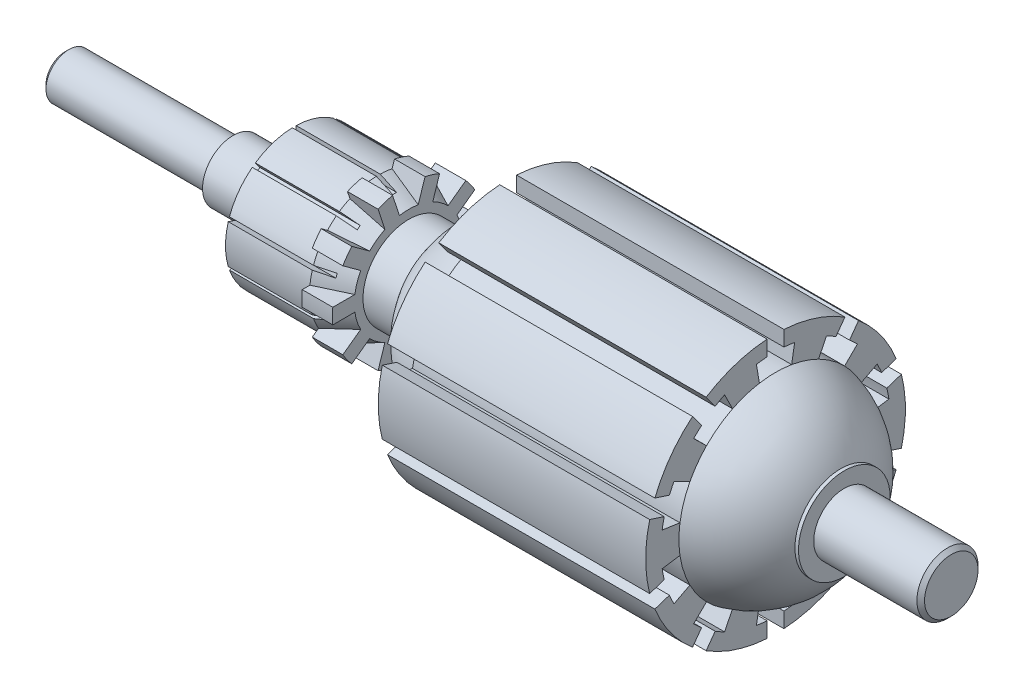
from build123d import *

# Parameters (mm, degrees)
CHANFREIN1_SIZE              = 0.5
ENL_V_MAT_EXTRU_1_DEPTH      = 63.785348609
R_P_TITION_CIRCULAIRE1_COUNT = 10
ENL_V_START                  = -4
ENL_V_MAT_EXTRU_2_DEPTH      = 4
R_P_TITION_CIRCULAIRE2_COUNT = 10
ESQUISSE4_R                  = 9
BOSS_EXTRU_1_DEPTH           = 4
BOSS_EXTRU_1_TAPER           = 25
ENL_V_MAT_EXTRU_3_REACH      = 91.29
R_P_TITION_CIRCULAIRE3_COUNT = 10


with BuildPart() as part:
    # Esquisse1 → Base-R_volution (revolve)
    with BuildSketch(Plane.XY, mode=Mode.PRIVATE) as base_r_volution_sk:
        with BuildLine():
            Line((0, 2.99), (22, 2.99))
            Line((22, 2.99), (22, 4))
            Line((22, 4), (30, 4))
            Line((30, 4), (30, 9))
            Line((30, 9), (41, 9))
            Line((41, 9), (41, 10))
            Line((41, 10), (45, 10))
            Line((45, 10), (45, 6))
            Line((45, 6), (49.467437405, 6))
            ThreePointArc((49.467437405, 6), (53.009285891, 10.25419368), (58, 12.649110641))
            Line((58, 12.649110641), (58, 17))
            Line((58, 17), (93, 17))
            Line((93, 17), (93, 12.649110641))
            ThreePointArc((93, 12.649110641), (97.990714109, 10.25419368), (101.532562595, 6))
            Line((101.532562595, 6), (102, 6))
            Line((102, 6), (102, 4))
            Line((102, 4), (116, 4))
            Line((116, 4), (116, 0))
            Line((116, 0), (0, 0))
            Line((0, 0), (0, 2.99))
        make_face()
    revolve(base_r_volution_sk.sketch.rotate(Axis((141, 0, 0), (-1, 0, 0)), 90), axis=Axis((141, 0, 0), (-1, 0, 0)))

    # Chanfrein1
    chanfrein1_edges = [part.edges().sort_by_distance(p)[0] for p in [
        (0, 0, 2.99),
        (116, 0, 4),
    ]]
    chamfer(chanfrein1_edges, length=CHANFREIN1_SIZE)

    # Esquisse2 → Enl_v. mat.-Extru.1 (cut, through all)
    with BuildSketch(Plane.ZY.offset(-58)):
        with BuildLine():
            Line((1.1, 16.964374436), (1.1, 14.959612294))
            ThreePointArc((1.1, 14.959612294), (1.801992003, 14.89136746), (2.5, 14.790199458))
            Line((2.5, 14.790199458), (2.108185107, 12.472191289))
            ThreePointArc((2.108185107, 12.472191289), (0, 12.649110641), (-2.108185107, 12.472191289))
            Line((-2.108185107, 12.472191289), (-2.5, 14.790199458))
            ThreePointArc((-2.5, 14.790199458), (-1.801992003, 14.89136746), (-1.1, 14.959612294))
            Line((-1.1, 14.959612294), (-1.1, 16.964374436))
            ThreePointArc((-1.1, 16.964374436), (0, 17), (1.1, 16.964374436))
        make_face()
    enl_v_mat_extru_1 = extrude(amount=-ENL_V_MAT_EXTRU_1_DEPTH, mode=Mode.SUBTRACT)

    # R_p_tition circulaire1: Enl_v. mat.-Extru.1 ×10 about axis
    r_p_tition_circulaire1_axis = Axis((0, 0, 0), (1, 0, 0))
    for i in range(1, R_P_TITION_CIRCULAIRE1_COUNT):
        add(enl_v_mat_extru_1.rotate(r_p_tition_circulaire1_axis, i * 360 / R_P_TITION_CIRCULAIRE1_COUNT), mode=Mode.SUBTRACT)

    # Esquisse3 → Enl_v. mat.-Extru.2 (cut)
    with BuildSketch(Plane.ZY.offset(-41).offset(ENL_V_START)):
        with BuildLine():
            Line((2.123623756, 9.771909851), (1.189876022, 6.898129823))
            ThreePointArc((1.189876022, 6.898129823), (0, 7), (-1.189876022, 6.898129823))
            Line((-1.189876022, 6.898129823), (-2.123623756, 9.771909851))
            ThreePointArc((-2.123623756, 9.771909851), (0, 10), (2.123623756, 9.771909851))
        make_face()
    enl_v_mat_extru_2 = extrude(amount=ENL_V_MAT_EXTRU_2_DEPTH, mode=Mode.SUBTRACT)

    # R_p_tition circulaire2: Enl_v. mat.-Extru.2 ×10 about axis
    r_p_tition_circulaire2_axis = Axis((0, 0, 0), (1, 0, 0))
    for i in range(1, R_P_TITION_CIRCULAIRE2_COUNT):
        add(enl_v_mat_extru_2.rotate(r_p_tition_circulaire2_axis, i * 360 / R_P_TITION_CIRCULAIRE2_COUNT), mode=Mode.SUBTRACT)

    # Esquisse4 → Boss.-Extru.1 (add)
    with BuildSketch(Plane(origin=(41, 0, 0), x_dir=(0, 0, -1), z_dir=(1, 0, 0))):
        Circle(ESQUISSE4_R)
    extrude(amount=BOSS_EXTRU_1_DEPTH, taper=BOSS_EXTRU_1_TAPER)

    # Esquisse5 → Enl_v. mat.-Extru.3 (cut, up to next)
    with BuildSketch(Plane.ZY.offset(-30), mode=Mode.PRIVATE) as enl_v_mat_extru_3_sk1:
        with BuildLine():
            Line((0.25, 8.996527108), (0.25, 7.996092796))
            ThreePointArc((0.25, 7.996092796), (0, 8), (-0.25, 7.996092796))
            Line((-0.25, 7.996092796), (-0.25, 8.996527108))
            ThreePointArc((-0.25, 8.996527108), (0, 9), (0.25, 8.996527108))
        make_face()
    enl_v_mat_extru_3_tool1 = extrude(enl_v_mat_extru_3_sk1.sketch, amount=-ENL_V_MAT_EXTRU_3_REACH, mode=Mode.PRIVATE) & part.part
    enl_v_mat_extru_3 = enl_v_mat_extru_3_tool1.solids().sort_by_distance((30, 8.49877, 0))[0]
    add(enl_v_mat_extru_3, mode=Mode.SUBTRACT)

    # R_p_tition circulaire3: Enl_v. mat.-Extru.3 ×10 about axis
    r_p_tition_circulaire3_axis = Axis((141, 0, 0), (-1, 0, 0))
    for i in range(1, R_P_TITION_CIRCULAIRE3_COUNT):
        add(enl_v_mat_extru_3.rotate(r_p_tition_circulaire3_axis, i * 360 / R_P_TITION_CIRCULAIRE3_COUNT), mode=Mode.SUBTRACT)


solid = part.part
